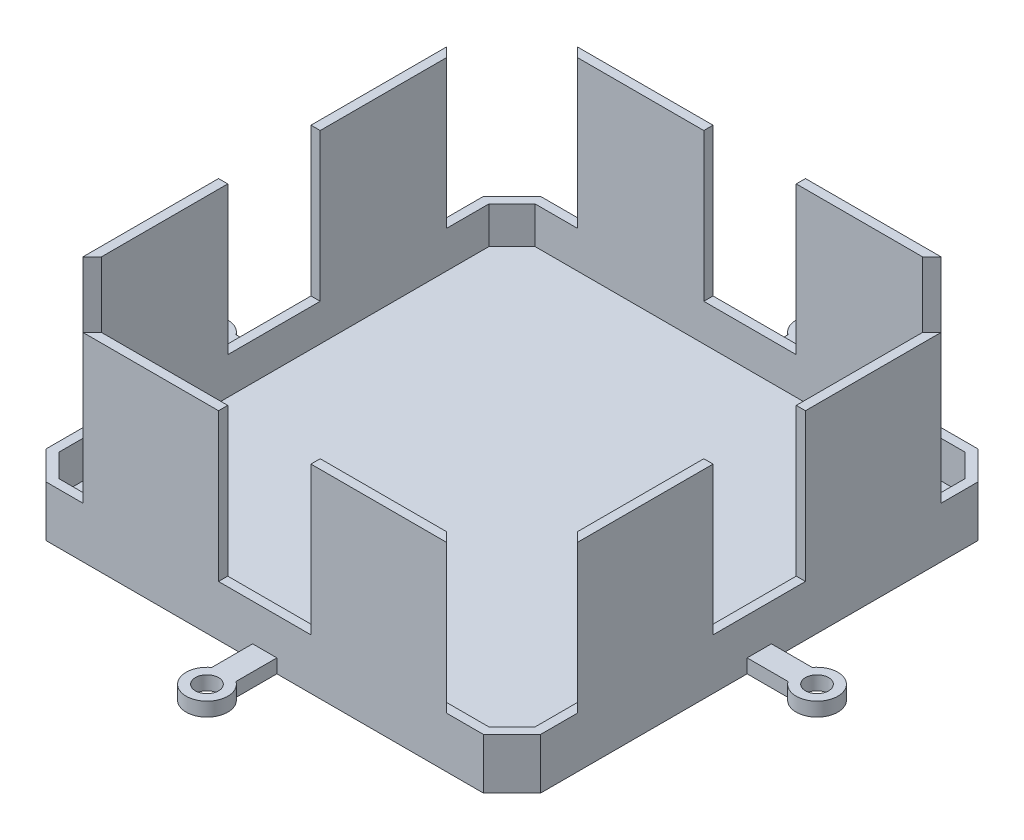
from build123d import *

# Parameters (mm, degrees)
EXTRUDED_WALLS_DEPTH  = 43
SKETCH2_R             = 2.5
EXTRUDED_BOTTOM_DEPTH = 3
SKETCH3_W             = 23
SKETCH3_H             = 20
SKETCH3_W_2           = 20
SKETCH3_H_2           = 23
CUT_EXTRUDE1_DEPTH    = 32


with BuildPart() as part:
    # Sketch1 → Extruded Walls (new body)
    with BuildSketch(Plane(origin=(0, 0, 0), x_dir=(1, 0, 0), z_dir=(0, 1, 0))):
        Polygon((-53.5, -47.328427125), (-53.5, 47.328427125), (-47.328427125, 53.5), (47.328427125, 53.5), (53.5, 47.328427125), (53.5, -47.328427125), (47.328427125, -53.5), (-47.328427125, -53.5), align=None)
        Polygon((46.5, 51.5), (51.5, 46.5), (51.5, -46.5), (46.5, -51.5), (-46.5, -51.5), (-51.5, -46.5), (-51.5, 46.5), (-46.5, 51.5), align=None, mode=Mode.SUBTRACT)
    extrude(amount=EXTRUDED_WALLS_DEPTH)

    # Sketch2 → Extruded Bottom (add)
    # profile 1 of 5: a face of its own
    with BuildSketch(Plane.XZ):
        Polygon((46.5, 51.5), (51.5, 46.5), (51.5, -46.5), (46.5, -51.5), (-46.5, -51.5), (-51.5, -46.5), (-51.5, 46.5), (-46.5, 51.5), align=None)
    # profile 2 of 5: a face of its own
    with BuildSketch(Plane.XZ):
        with BuildLine():
            Line((53.5, 2.625), (53.5, -2.625))
            Line((53.5, -2.625), (62.344952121, -2.625))
            ThreePointArc((62.344952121, -2.625), (70.5, 0), (62.344952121, 2.625))
            Line((62.344952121, 2.625), (53.5, 2.625))
        make_face()
        with Locations(Location((66, 0, 0), (0, 0, 270))):
            Circle(SKETCH2_R, mode=Mode.SUBTRACT)
    # profile 3 of 5: a face of its own
    with BuildSketch(Plane.XZ):
        with BuildLine():
            Line((2.625, -53.5), (-2.625, -53.5))
            Line((-2.625, -53.5), (-2.625, -62.344952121))
            ThreePointArc((-2.625, -62.344952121), (0, -70.5), (2.625, -62.344952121))
            Line((2.625, -62.344952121), (2.625, -53.5))
        make_face()
        with Locations(Location((0, -66, 0), (0, 0, 270))):
            Circle(SKETCH2_R, mode=Mode.SUBTRACT)
    # profile 4 of 5: a face of its own
    with BuildSketch(Plane.XZ):
        with BuildLine():
            Line((-53.5, -2.625), (-53.5, 2.625))
            Line((-53.5, 2.625), (-62.344952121, 2.625))
            ThreePointArc((-62.344952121, 2.625), (-70.5, 0), (-62.344952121, -2.625))
            Line((-62.344952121, -2.625), (-53.5, -2.625))
        make_face()
        with Locations(Location((-66, 0, 0), (0, 0, 270))):
            Circle(SKETCH2_R, mode=Mode.SUBTRACT)
    # profile 5 of 5: a face of its own
    with BuildSketch(Plane.XZ):
        with BuildLine():
            Line((-2.625, 53.5), (2.625, 53.5))
            Line((2.625, 53.5), (2.625, 62.344952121))
            ThreePointArc((2.625, 62.344952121), (0, 70.5), (-2.625, 62.344952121))
            Line((-2.625, 62.344952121), (-2.625, 53.5))
        make_face()
        with Locations(Location((0, 66, 0), (0, 0, 270))):
            Circle(SKETCH2_R, mode=Mode.SUBTRACT)
    extrude(amount=-EXTRUDED_BOTTOM_DEPTH)

    # Sketch3 → Cut-Extrude1 (cut)
    with BuildSketch(Plane(origin=(0, 43, 0), x_dir=(1, 0, 0), z_dir=(0, 1, 0))):
        with Locations((61.5, 0)):
            Rectangle(SKETCH3_W, SKETCH3_H)
        Polygon((44.547727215, -58.689862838), (28.284271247, -42.426406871), (42.426406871, -28.284271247), (58.689862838, -44.547727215), align=None)
        with Locations((0, -61.5)):
            Rectangle(SKETCH3_W_2, SKETCH3_H_2)
        Polygon((-58.689862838, -44.547727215), (-42.426406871, -28.284271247), (-28.284271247, -42.426406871), (-44.547727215, -58.689862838), align=None)
        with Locations((-61.5, 0)):
            Rectangle(SKETCH3_W, SKETCH3_H)
        Polygon((-44.547727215, 58.689862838), (-28.284271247, 42.426406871), (-42.426406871, 28.284271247), (-58.689862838, 44.547727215), align=None)
        with Locations((0, 61.5)):
            Rectangle(SKETCH3_W_2, SKETCH3_H_2)
        Polygon((58.689862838, 44.547727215), (42.426406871, 28.284271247), (28.284271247, 42.426406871), (44.547727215, 58.689862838), align=None)
    extrude(amount=-CUT_EXTRUDE1_DEPTH, mode=Mode.SUBTRACT)


solid = part.part
